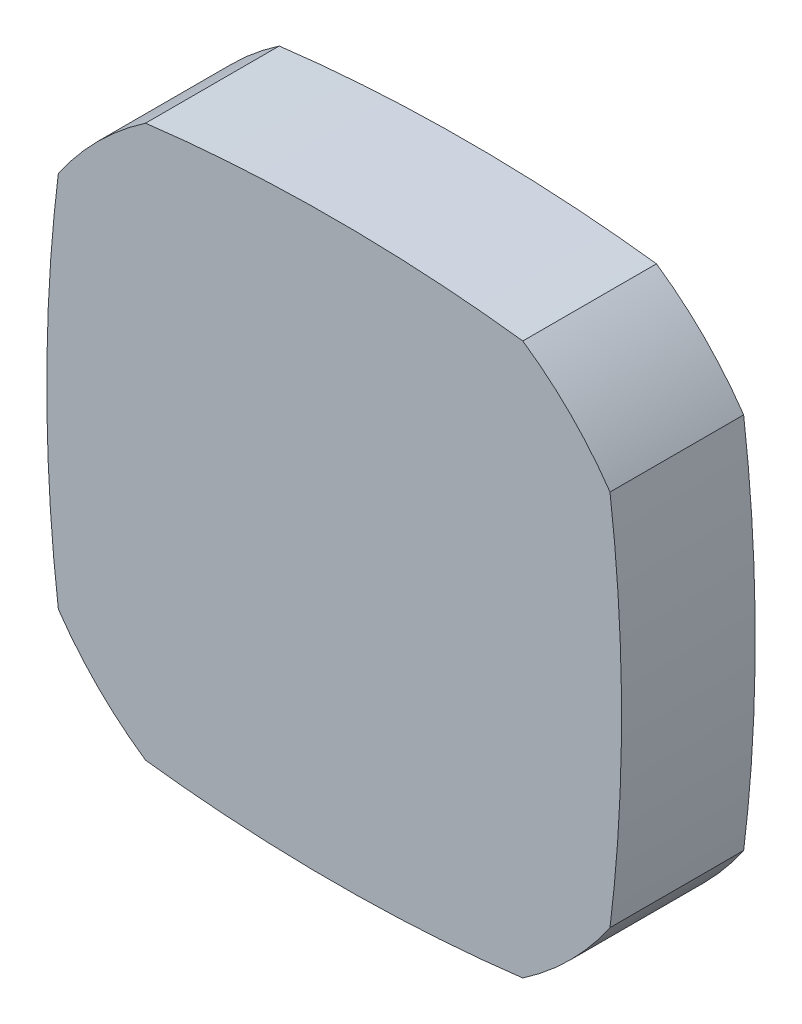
ISO-10303-21;
HEADER;
FILE_DESCRIPTION(('STEP AP214'),'2;1');
FILE_NAME('part.step','',(''),(''),'','','');
FILE_SCHEMA(('AUTOMOTIVE_DESIGN { 1 0 10303 214 1 1 1 1 }'));
ENDSEC;
DATA;
#1=APPLICATION_CONTEXT('core data for automotive mechanical design processes');
#2=APPLICATION_PROTOCOL_DEFINITION('international standard','automotive_design',2000,#1);
#3=PRODUCT_CONTEXT('',#1,'mechanical');
#4=PRODUCT('Part','Part','',(#3));
#5=PRODUCT_RELATED_PRODUCT_CATEGORY('part','',(#4));
#6=PRODUCT_DEFINITION_FORMATION('','',#4);
#7=PRODUCT_DEFINITION_CONTEXT('part definition',#1,'design');
#8=PRODUCT_DEFINITION('design','',#6,#7);
#9=PRODUCT_DEFINITION_SHAPE('','',#8);
#10=(LENGTH_UNIT() NAMED_UNIT(*) SI_UNIT(.MILLI.,.METRE.));
#11=(NAMED_UNIT(*) PLANE_ANGLE_UNIT() SI_UNIT($,.RADIAN.));
#12=(NAMED_UNIT(*) SI_UNIT($,.STERADIAN.) SOLID_ANGLE_UNIT());
#13=UNCERTAINTY_MEASURE_WITH_UNIT(LENGTH_MEASURE(1.E-05),#10,'distance_accuracy_value','');
#14=(GEOMETRIC_REPRESENTATION_CONTEXT(3) GLOBAL_UNCERTAINTY_ASSIGNED_CONTEXT((#13)) GLOBAL_UNIT_ASSIGNED_CONTEXT((#10,
#11,#12)) REPRESENTATION_CONTEXT('',''));
#15=CARTESIAN_POINT('',(0.,0.,0.));
#16=DIRECTION('',(0.,0.,1.));
#17=DIRECTION('',(1.,0.,0.));
#18=AXIS2_PLACEMENT_3D('',#15,#16,#17);
#19=CARTESIAN_POINT('',(14.1121650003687,20.6360558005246,10.));
#20=CARTESIAN_POINT('',(13.8078064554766,20.6733063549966,10.));
#21=CARTESIAN_POINT('',(13.1951830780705,20.7482855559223,10.));
#22=CARTESIAN_POINT('',(12.2694711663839,20.851373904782,10.));
#23=CARTESIAN_POINT('',(11.3320520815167,20.9482320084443,10.));
#24=CARTESIAN_POINT('',(10.3837103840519,21.0378521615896,10.));
#25=CARTESIAN_POINT('',(9.42536374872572,21.1201827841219,10.));
#26=CARTESIAN_POINT('',(8.45791296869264,21.1949385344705,10.));
#27=CARTESIAN_POINT('',(7.48228110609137,21.261925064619,10.));
#28=CARTESIAN_POINT('',(6.49940110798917,21.3209512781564,10.));
#29=CARTESIAN_POINT('',(5.51021740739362,21.3718536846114,10.));
#30=CARTESIAN_POINT('',(4.51568370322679,21.4144902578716,10.));
#31=CARTESIAN_POINT('',(3.5167617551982,21.4487424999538,10.));
#32=CARTESIAN_POINT('',(2.51441988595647,21.4745152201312,10.));
#33=CARTESIAN_POINT('',(1.50963154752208,21.4917368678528,10.));
#34=CARTESIAN_POINT('',(0.503373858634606,21.5003596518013,10.));
#35=CARTESIAN_POINT('',(-0.503373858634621,21.5003596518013,10.));
#36=CARTESIAN_POINT('',(-1.5096315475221,21.4917368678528,10.));
#37=CARTESIAN_POINT('',(-2.51441988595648,21.4745152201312,10.));
#38=CARTESIAN_POINT('',(-3.51676175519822,21.4487424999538,10.));
#39=CARTESIAN_POINT('',(-4.51568370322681,21.4144902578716,10.));
#40=CARTESIAN_POINT('',(-5.51021740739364,21.3718536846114,10.));
#41=CARTESIAN_POINT('',(-6.49940110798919,21.3209512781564,10.));
#42=CARTESIAN_POINT('',(-7.48228110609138,21.261925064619,10.));
#43=CARTESIAN_POINT('',(-8.45791296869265,21.1949385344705,10.));
#44=CARTESIAN_POINT('',(-9.42536374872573,21.1201827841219,10.));
#45=CARTESIAN_POINT('',(-10.3837103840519,21.0378521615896,10.));
#46=CARTESIAN_POINT('',(-11.3320520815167,20.9482320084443,10.));
#47=CARTESIAN_POINT('',(-12.2694711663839,20.851373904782,10.));
#48=CARTESIAN_POINT('',(-13.1951830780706,20.7482855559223,10.));
#49=CARTESIAN_POINT('',(-13.8078064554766,20.6733063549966,10.));
#50=CARTESIAN_POINT('',(-14.1121650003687,20.6360558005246,10.));
#51=B_SPLINE_CURVE_WITH_KNOTS('',3,(#19,#20,#21,#22,#23,#24,#25,#26,#27,#28,#29,#30,#31,#32,#33,
#34,#35,#36,#37,#38,#39,#40,#41,#42,#43,#44,#45,#46,#47,#48,#49,#50),.UNSPECIFIED.,.F.,.F.,(4,1,
1,1,1,1,1,1,1,1,1,1,1,1,1,1,1,1,1,1,1,1,1,1,1,1,1,1,1,4),(0.,0.032510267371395,
0.0654377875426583,0.0987536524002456,0.132428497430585,0.166432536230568,0.200735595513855,
0.235307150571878,0.270116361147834,0.305132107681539,0.340323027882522,0.375657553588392,
0.411103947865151,0.446630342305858,0.482204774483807,0.517795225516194,0.553369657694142,
0.588896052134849,0.624342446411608,0.659676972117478,0.694867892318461,0.729883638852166,
0.764692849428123,0.799264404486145,0.833567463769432,0.867571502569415,0.901246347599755,
0.934562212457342,0.967489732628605,1.),.UNSPECIFIED.);
#52=DIRECTION('',(0.,0.,-1.));
#53=VECTOR('',#52,1.);
#54=SURFACE_OF_LINEAR_EXTRUSION('',#51,#53);
#55=CARTESIAN_POINT('',(14.1121650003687,20.6360558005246,0.));
#56=CARTESIAN_POINT('',(13.8078064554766,20.6733063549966,0.));
#57=CARTESIAN_POINT('',(13.1951830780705,20.7482855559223,0.));
#58=CARTESIAN_POINT('',(12.2694711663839,20.851373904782,0.));
#59=CARTESIAN_POINT('',(11.3320520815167,20.9482320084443,0.));
#60=CARTESIAN_POINT('',(10.3837103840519,21.0378521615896,0.));
#61=CARTESIAN_POINT('',(9.42536374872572,21.1201827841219,0.));
#62=CARTESIAN_POINT('',(8.45791296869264,21.1949385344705,0.));
#63=CARTESIAN_POINT('',(7.48228110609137,21.261925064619,0.));
#64=CARTESIAN_POINT('',(6.49940110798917,21.3209512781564,0.));
#65=CARTESIAN_POINT('',(5.51021740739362,21.3718536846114,0.));
#66=CARTESIAN_POINT('',(4.51568370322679,21.4144902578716,0.));
#67=CARTESIAN_POINT('',(3.5167617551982,21.4487424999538,0.));
#68=CARTESIAN_POINT('',(2.51441988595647,21.4745152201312,0.));
#69=CARTESIAN_POINT('',(1.50963154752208,21.4917368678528,0.));
#70=CARTESIAN_POINT('',(0.503373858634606,21.5003596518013,0.));
#71=CARTESIAN_POINT('',(-0.503373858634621,21.5003596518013,0.));
#72=CARTESIAN_POINT('',(-1.5096315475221,21.4917368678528,0.));
#73=CARTESIAN_POINT('',(-2.51441988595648,21.4745152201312,0.));
#74=CARTESIAN_POINT('',(-3.51676175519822,21.4487424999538,0.));
#75=CARTESIAN_POINT('',(-4.51568370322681,21.4144902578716,0.));
#76=CARTESIAN_POINT('',(-5.51021740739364,21.3718536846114,0.));
#77=CARTESIAN_POINT('',(-6.49940110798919,21.3209512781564,0.));
#78=CARTESIAN_POINT('',(-7.48228110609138,21.261925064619,0.));
#79=CARTESIAN_POINT('',(-8.45791296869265,21.1949385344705,0.));
#80=CARTESIAN_POINT('',(-9.42536374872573,21.1201827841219,0.));
#81=CARTESIAN_POINT('',(-10.3837103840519,21.0378521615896,0.));
#82=CARTESIAN_POINT('',(-11.3320520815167,20.9482320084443,0.));
#83=CARTESIAN_POINT('',(-12.2694711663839,20.851373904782,0.));
#84=CARTESIAN_POINT('',(-13.1951830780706,20.7482855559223,0.));
#85=CARTESIAN_POINT('',(-13.8078064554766,20.6733063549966,0.));
#86=CARTESIAN_POINT('',(-14.1121650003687,20.6360558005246,0.));
#87=B_SPLINE_CURVE_WITH_KNOTS('',3,(#55,#56,#57,#58,#59,#60,#61,#62,#63,#64,#65,#66,#67,#68,#69,
#70,#71,#72,#73,#74,#75,#76,#77,#78,#79,#80,#81,#82,#83,#84,#85,#86),.UNSPECIFIED.,.F.,.F.,(4,1,
1,1,1,1,1,1,1,1,1,1,1,1,1,1,1,1,1,1,1,1,1,1,1,1,1,1,1,4),(0.,0.032510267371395,
0.0654377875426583,0.0987536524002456,0.132428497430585,0.166432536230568,0.200735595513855,
0.235307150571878,0.270116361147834,0.305132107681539,0.340323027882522,0.375657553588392,
0.411103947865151,0.446630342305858,0.482204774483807,0.517795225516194,0.553369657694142,
0.588896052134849,0.624342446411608,0.659676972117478,0.694867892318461,0.729883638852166,
0.764692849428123,0.799264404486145,0.833567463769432,0.867571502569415,0.901246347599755,
0.934562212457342,0.967489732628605,1.),.UNSPECIFIED.);
#88=CARTESIAN_POINT('',(14.1121650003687,20.6360558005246,0.));
#89=VERTEX_POINT('',#88);
#90=CARTESIAN_POINT('',(-14.1121650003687,20.6360558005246,0.));
#91=VERTEX_POINT('',#90);
#92=EDGE_CURVE('E104',#89,#91,#87,.T.);
#93=ORIENTED_EDGE('',*,*,#92,.T.);
#94=DIRECTION('',(0.,0.,-1.));
#95=VECTOR('',#94,1.);
#96=CARTESIAN_POINT('',(-14.1121650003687,20.6360558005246,10.));
#97=LINE('',#96,#95);
#98=CARTESIAN_POINT('',(-14.1121650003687,20.6360558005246,10.));
#99=VERTEX_POINT('',#98);
#100=EDGE_CURVE('E11',#99,#91,#97,.T.);
#101=ORIENTED_EDGE('',*,*,#100,.F.);
#102=CARTESIAN_POINT('',(14.1121650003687,20.6360558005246,10.));
#103=VERTEX_POINT('',#102);
#104=EDGE_CURVE('E150',#103,#99,#51,.T.);
#105=ORIENTED_EDGE('',*,*,#104,.F.);
#106=DIRECTION('',(0.,0.,-1.));
#107=VECTOR('',#106,1.);
#108=CARTESIAN_POINT('',(14.1121650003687,20.6360558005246,10.));
#109=LINE('',#108,#107);
#110=EDGE_CURVE('E117',#103,#89,#109,.T.);
#111=ORIENTED_EDGE('',*,*,#110,.T.);
#112=EDGE_LOOP('',(#93,#101,#105,#111));
#113=FACE_BOUND('',#112,.T.);
#114=ADVANCED_FACE('F35',(#113),#54,.F.);
#115=CARTESIAN_POINT('',(0.,0.,10.));
#116=DIRECTION('',(0.,0.,-1.));
#117=DIRECTION('',(-1.,0.,0.));
#118=AXIS2_PLACEMENT_3D('',#115,#116,#117);
#119=CYLINDRICAL_SURFACE('',#118,24.9999999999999);
#120=CARTESIAN_POINT('',(0.,0.,0.));
#121=DIRECTION('',(0.,0.,1.));
#122=DIRECTION('',(-1.,0.,0.));
#123=AXIS2_PLACEMENT_3D('',#120,#121,#122);
#124=CIRCLE('',#123,24.9999999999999);
#125=CARTESIAN_POINT('',(-20.6360558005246,14.1121650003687,0.));
#126=VERTEX_POINT('',#125);
#127=EDGE_CURVE('E100',#91,#126,#124,.T.);
#128=ORIENTED_EDGE('',*,*,#127,.T.);
#129=DIRECTION('',(0.,0.,-1.));
#130=VECTOR('',#129,1.);
#131=CARTESIAN_POINT('',(-20.6360558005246,14.1121650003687,10.));
#132=LINE('',#131,#130);
#133=CARTESIAN_POINT('',(-20.6360558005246,14.1121650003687,10.));
#134=VERTEX_POINT('',#133);
#135=EDGE_CURVE('E43',#134,#126,#132,.T.);
#136=ORIENTED_EDGE('',*,*,#135,.F.);
#137=CARTESIAN_POINT('',(0.,0.,10.));
#138=DIRECTION('',(0.,0.,1.));
#139=DIRECTION('',(-1.,0.,0.));
#140=AXIS2_PLACEMENT_3D('',#137,#138,#139);
#141=CIRCLE('',#140,24.9999999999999);
#142=EDGE_CURVE('E113',#99,#134,#141,.T.);
#143=ORIENTED_EDGE('',*,*,#142,.F.);
#144=ORIENTED_EDGE('',*,*,#100,.T.);
#145=EDGE_LOOP('',(#128,#136,#143,#144));
#146=FACE_BOUND('',#145,.T.);
#147=ADVANCED_FACE('F112',(#146),#119,.T.);
#148=CARTESIAN_POINT('',(-20.6360558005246,14.1121650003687,10.));
#149=CARTESIAN_POINT('',(-20.6733063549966,13.8078064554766,10.));
#150=CARTESIAN_POINT('',(-20.7482855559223,13.1951830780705,10.));
#151=CARTESIAN_POINT('',(-20.851373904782,12.2694711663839,10.));
#152=CARTESIAN_POINT('',(-20.9482320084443,11.3320520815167,10.));
#153=CARTESIAN_POINT('',(-21.0378521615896,10.3837103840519,10.));
#154=CARTESIAN_POINT('',(-21.1201827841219,9.42536374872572,10.));
#155=CARTESIAN_POINT('',(-21.1949385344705,8.45791296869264,10.));
#156=CARTESIAN_POINT('',(-21.261925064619,7.48228110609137,10.));
#157=CARTESIAN_POINT('',(-21.3209512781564,6.49940110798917,10.));
#158=CARTESIAN_POINT('',(-21.3718536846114,5.51021740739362,10.));
#159=CARTESIAN_POINT('',(-21.4144902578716,4.51568370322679,10.));
#160=CARTESIAN_POINT('',(-21.4487424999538,3.5167617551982,10.));
#161=CARTESIAN_POINT('',(-21.4745152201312,2.51441988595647,10.));
#162=CARTESIAN_POINT('',(-21.4917368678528,1.50963154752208,10.));
#163=CARTESIAN_POINT('',(-21.5003596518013,0.503373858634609,10.));
#164=CARTESIAN_POINT('',(-21.5003596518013,-0.503373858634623,10.));
#165=CARTESIAN_POINT('',(-21.4917368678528,-1.5096315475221,10.));
#166=CARTESIAN_POINT('',(-21.4745152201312,-2.51441988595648,10.));
#167=CARTESIAN_POINT('',(-21.4487424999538,-3.51676175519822,10.));
#168=CARTESIAN_POINT('',(-21.4144902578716,-4.51568370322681,10.));
#169=CARTESIAN_POINT('',(-21.3718536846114,-5.51021740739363,10.));
#170=CARTESIAN_POINT('',(-21.3209512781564,-6.49940110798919,10.));
#171=CARTESIAN_POINT('',(-21.261925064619,-7.48228110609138,10.));
#172=CARTESIAN_POINT('',(-21.1949385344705,-8.45791296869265,10.));
#173=CARTESIAN_POINT('',(-21.1201827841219,-9.42536374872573,10.));
#174=CARTESIAN_POINT('',(-21.0378521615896,-10.3837103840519,10.));
#175=CARTESIAN_POINT('',(-20.9482320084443,-11.3320520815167,10.));
#176=CARTESIAN_POINT('',(-20.851373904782,-12.2694711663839,10.));
#177=CARTESIAN_POINT('',(-20.7482855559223,-13.1951830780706,10.));
#178=CARTESIAN_POINT('',(-20.6733063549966,-13.8078064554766,10.));
#179=CARTESIAN_POINT('',(-20.6360558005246,-14.1121650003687,10.));
#180=B_SPLINE_CURVE_WITH_KNOTS('',3,(#148,#149,#150,#151,#152,#153,#154,#155,#156,#157,#158,
#159,#160,#161,#162,#163,#164,#165,#166,#167,#168,#169,#170,#171,#172,#173,#174,#175,#176,#177,
#178,#179),.UNSPECIFIED.,.F.,.F.,(4,1,1,1,1,1,1,1,1,1,1,1,1,1,1,1,1,1,1,1,1,1,1,1,1,1,1,1,1,4),
(0.,0.0325102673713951,0.0654377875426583,0.0987536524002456,0.132428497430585,
0.166432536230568,0.200735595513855,0.235307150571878,0.270116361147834,0.305132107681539,
0.340323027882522,0.375657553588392,0.411103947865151,0.446630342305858,0.482204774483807,
0.517795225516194,0.553369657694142,0.58889605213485,0.624342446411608,0.659676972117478,
0.694867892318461,0.729883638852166,0.764692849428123,0.799264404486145,0.833567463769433,
0.867571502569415,0.901246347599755,0.934562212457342,0.967489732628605,1.),.UNSPECIFIED.);
#181=DIRECTION('',(0.,0.,-1.));
#182=VECTOR('',#181,1.);
#183=SURFACE_OF_LINEAR_EXTRUSION('',#180,#182);
#184=CARTESIAN_POINT('',(-20.6360558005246,14.1121650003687,0.));
#185=CARTESIAN_POINT('',(-20.6733063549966,13.8078064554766,0.));
#186=CARTESIAN_POINT('',(-20.7482855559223,13.1951830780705,0.));
#187=CARTESIAN_POINT('',(-20.851373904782,12.2694711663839,0.));
#188=CARTESIAN_POINT('',(-20.9482320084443,11.3320520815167,0.));
#189=CARTESIAN_POINT('',(-21.0378521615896,10.3837103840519,0.));
#190=CARTESIAN_POINT('',(-21.1201827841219,9.42536374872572,0.));
#191=CARTESIAN_POINT('',(-21.1949385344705,8.45791296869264,0.));
#192=CARTESIAN_POINT('',(-21.261925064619,7.48228110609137,0.));
#193=CARTESIAN_POINT('',(-21.3209512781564,6.49940110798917,0.));
#194=CARTESIAN_POINT('',(-21.3718536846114,5.51021740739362,0.));
#195=CARTESIAN_POINT('',(-21.4144902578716,4.51568370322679,0.));
#196=CARTESIAN_POINT('',(-21.4487424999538,3.5167617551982,0.));
#197=CARTESIAN_POINT('',(-21.4745152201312,2.51441988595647,0.));
#198=CARTESIAN_POINT('',(-21.4917368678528,1.50963154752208,0.));
#199=CARTESIAN_POINT('',(-21.5003596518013,0.503373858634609,0.));
#200=CARTESIAN_POINT('',(-21.5003596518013,-0.503373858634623,0.));
#201=CARTESIAN_POINT('',(-21.4917368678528,-1.5096315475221,0.));
#202=CARTESIAN_POINT('',(-21.4745152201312,-2.51441988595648,0.));
#203=CARTESIAN_POINT('',(-21.4487424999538,-3.51676175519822,0.));
#204=CARTESIAN_POINT('',(-21.4144902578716,-4.51568370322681,0.));
#205=CARTESIAN_POINT('',(-21.3718536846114,-5.51021740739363,0.));
#206=CARTESIAN_POINT('',(-21.3209512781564,-6.49940110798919,0.));
#207=CARTESIAN_POINT('',(-21.261925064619,-7.48228110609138,0.));
#208=CARTESIAN_POINT('',(-21.1949385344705,-8.45791296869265,0.));
#209=CARTESIAN_POINT('',(-21.1201827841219,-9.42536374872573,0.));
#210=CARTESIAN_POINT('',(-21.0378521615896,-10.3837103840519,0.));
#211=CARTESIAN_POINT('',(-20.9482320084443,-11.3320520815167,0.));
#212=CARTESIAN_POINT('',(-20.851373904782,-12.2694711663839,0.));
#213=CARTESIAN_POINT('',(-20.7482855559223,-13.1951830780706,0.));
#214=CARTESIAN_POINT('',(-20.6733063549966,-13.8078064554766,0.));
#215=CARTESIAN_POINT('',(-20.6360558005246,-14.1121650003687,0.));
#216=B_SPLINE_CURVE_WITH_KNOTS('',3,(#184,#185,#186,#187,#188,#189,#190,#191,#192,#193,#194,
#195,#196,#197,#198,#199,#200,#201,#202,#203,#204,#205,#206,#207,#208,#209,#210,#211,#212,#213,
#214,#215),.UNSPECIFIED.,.F.,.F.,(4,1,1,1,1,1,1,1,1,1,1,1,1,1,1,1,1,1,1,1,1,1,1,1,1,1,1,1,1,4),
(0.,0.0325102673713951,0.0654377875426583,0.0987536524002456,0.132428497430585,
0.166432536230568,0.200735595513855,0.235307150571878,0.270116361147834,0.305132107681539,
0.340323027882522,0.375657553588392,0.411103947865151,0.446630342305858,0.482204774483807,
0.517795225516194,0.553369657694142,0.58889605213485,0.624342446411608,0.659676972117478,
0.694867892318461,0.729883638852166,0.764692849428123,0.799264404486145,0.833567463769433,
0.867571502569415,0.901246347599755,0.934562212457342,0.967489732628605,1.),.UNSPECIFIED.);
#217=CARTESIAN_POINT('',(-20.6360558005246,-14.1121650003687,0.));
#218=VERTEX_POINT('',#217);
#219=EDGE_CURVE('E106',#126,#218,#216,.T.);
#220=ORIENTED_EDGE('',*,*,#219,.T.);
#221=DIRECTION('',(0.,0.,-1.));
#222=VECTOR('',#221,1.);
#223=CARTESIAN_POINT('',(-20.6360558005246,-14.1121650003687,10.));
#224=LINE('',#223,#222);
#225=CARTESIAN_POINT('',(-20.6360558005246,-14.1121650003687,10.));
#226=VERTEX_POINT('',#225);
#227=EDGE_CURVE('E284',#226,#218,#224,.T.);
#228=ORIENTED_EDGE('',*,*,#227,.F.);
#229=EDGE_CURVE('E159',#134,#226,#180,.T.);
#230=ORIENTED_EDGE('',*,*,#229,.F.);
#231=ORIENTED_EDGE('',*,*,#135,.T.);
#232=EDGE_LOOP('',(#220,#228,#230,#231));
#233=FACE_BOUND('',#232,.T.);
#234=ADVANCED_FACE('F170',(#233),#183,.F.);
#235=CARTESIAN_POINT('',(0.,0.,10.));
#236=DIRECTION('',(0.,0.,-1.));
#237=DIRECTION('',(-1.,0.,0.));
#238=AXIS2_PLACEMENT_3D('',#235,#236,#237);
#239=CYLINDRICAL_SURFACE('',#238,24.9999999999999);
#240=CARTESIAN_POINT('',(0.,0.,0.));
#241=DIRECTION('',(0.,0.,1.));
#242=DIRECTION('',(-1.,0.,0.));
#243=AXIS2_PLACEMENT_3D('',#240,#241,#242);
#244=CIRCLE('',#243,24.9999999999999);
#245=CARTESIAN_POINT('',(-14.1121650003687,-20.6360558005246,0.));
#246=VERTEX_POINT('',#245);
#247=EDGE_CURVE('E128',#218,#246,#244,.T.);
#248=ORIENTED_EDGE('',*,*,#247,.T.);
#249=DIRECTION('',(0.,0.,-1.));
#250=VECTOR('',#249,1.);
#251=CARTESIAN_POINT('',(-14.1121650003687,-20.6360558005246,10.));
#252=LINE('',#251,#250);
#253=CARTESIAN_POINT('',(-14.1121650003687,-20.6360558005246,10.));
#254=VERTEX_POINT('',#253);
#255=EDGE_CURVE('E281',#254,#246,#252,.T.);
#256=ORIENTED_EDGE('',*,*,#255,.F.);
#257=CARTESIAN_POINT('',(0.,0.,10.));
#258=DIRECTION('',(0.,0.,1.));
#259=DIRECTION('',(-1.,0.,0.));
#260=AXIS2_PLACEMENT_3D('',#257,#258,#259);
#261=CIRCLE('',#260,24.9999999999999);
#262=EDGE_CURVE('E164',#226,#254,#261,.T.);
#263=ORIENTED_EDGE('',*,*,#262,.F.);
#264=ORIENTED_EDGE('',*,*,#227,.T.);
#265=EDGE_LOOP('',(#248,#256,#263,#264));
#266=FACE_BOUND('',#265,.T.);
#267=ADVANCED_FACE('F173',(#266),#239,.T.);
#268=CARTESIAN_POINT('',(-14.1121650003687,-20.6360558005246,10.));
#269=CARTESIAN_POINT('',(-13.8078064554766,-20.6733063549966,10.));
#270=CARTESIAN_POINT('',(-13.1951830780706,-20.7482855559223,10.));
#271=CARTESIAN_POINT('',(-12.2694711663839,-20.851373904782,10.));
#272=CARTESIAN_POINT('',(-11.3320520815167,-20.9482320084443,10.));
#273=CARTESIAN_POINT('',(-10.3837103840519,-21.0378521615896,10.));
#274=CARTESIAN_POINT('',(-9.42536374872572,-21.1201827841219,10.));
#275=CARTESIAN_POINT('',(-8.45791296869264,-21.1949385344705,10.));
#276=CARTESIAN_POINT('',(-7.48228110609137,-21.261925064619,10.));
#277=CARTESIAN_POINT('',(-6.49940110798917,-21.3209512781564,10.));
#278=CARTESIAN_POINT('',(-5.51021740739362,-21.3718536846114,10.));
#279=CARTESIAN_POINT('',(-4.5156837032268,-21.4144902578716,10.));
#280=CARTESIAN_POINT('',(-3.5167617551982,-21.4487424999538,10.));
#281=CARTESIAN_POINT('',(-2.51441988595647,-21.4745152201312,10.));
#282=CARTESIAN_POINT('',(-1.50963154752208,-21.4917368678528,10.));
#283=CARTESIAN_POINT('',(-0.503373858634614,-21.5003596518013,10.));
#284=CARTESIAN_POINT('',(0.503373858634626,-21.5003596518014,10.));
#285=CARTESIAN_POINT('',(1.50963154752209,-21.4917368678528,10.));
#286=CARTESIAN_POINT('',(2.51441988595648,-21.4745152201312,10.));
#287=CARTESIAN_POINT('',(3.51676175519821,-21.4487424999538,10.));
#288=CARTESIAN_POINT('',(4.5156837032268,-21.4144902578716,10.));
#289=CARTESIAN_POINT('',(5.51021740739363,-21.3718536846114,10.));
#290=CARTESIAN_POINT('',(6.49940110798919,-21.3209512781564,10.));
#291=CARTESIAN_POINT('',(7.48228110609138,-21.261925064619,10.));
#292=CARTESIAN_POINT('',(8.45791296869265,-21.1949385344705,10.));
#293=CARTESIAN_POINT('',(9.42536374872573,-21.1201827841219,10.));
#294=CARTESIAN_POINT('',(10.3837103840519,-21.0378521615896,10.));
#295=CARTESIAN_POINT('',(11.3320520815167,-20.9482320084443,10.));
#296=CARTESIAN_POINT('',(12.2694711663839,-20.851373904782,10.));
#297=CARTESIAN_POINT('',(13.1951830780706,-20.7482855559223,10.));
#298=CARTESIAN_POINT('',(13.8078064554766,-20.6733063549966,10.));
#299=CARTESIAN_POINT('',(14.1121650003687,-20.6360558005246,10.));
#300=B_SPLINE_CURVE_WITH_KNOTS('',3,(#268,#269,#270,#271,#272,#273,#274,#275,#276,#277,#278,
#279,#280,#281,#282,#283,#284,#285,#286,#287,#288,#289,#290,#291,#292,#293,#294,#295,#296,#297,
#298,#299),.UNSPECIFIED.,.F.,.F.,(4,1,1,1,1,1,1,1,1,1,1,1,1,1,1,1,1,1,1,1,1,1,1,1,1,1,1,1,1,4),
(0.,0.0325102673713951,0.0654377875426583,0.0987536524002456,0.132428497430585,
0.166432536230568,0.200735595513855,0.235307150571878,0.270116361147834,0.305132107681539,
0.340323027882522,0.375657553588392,0.411103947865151,0.446630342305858,0.482204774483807,
0.517795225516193,0.553369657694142,0.58889605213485,0.624342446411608,0.659676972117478,
0.694867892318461,0.729883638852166,0.764692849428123,0.799264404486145,0.833567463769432,
0.867571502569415,0.901246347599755,0.934562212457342,0.967489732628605,1.),.UNSPECIFIED.);
#301=DIRECTION('',(0.,0.,-1.));
#302=VECTOR('',#301,1.);
#303=SURFACE_OF_LINEAR_EXTRUSION('',#300,#302);
#304=CARTESIAN_POINT('',(-14.1121650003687,-20.6360558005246,0.));
#305=CARTESIAN_POINT('',(-13.8078064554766,-20.6733063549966,0.));
#306=CARTESIAN_POINT('',(-13.1951830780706,-20.7482855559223,0.));
#307=CARTESIAN_POINT('',(-12.2694711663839,-20.851373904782,0.));
#308=CARTESIAN_POINT('',(-11.3320520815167,-20.9482320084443,0.));
#309=CARTESIAN_POINT('',(-10.3837103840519,-21.0378521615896,0.));
#310=CARTESIAN_POINT('',(-9.42536374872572,-21.1201827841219,0.));
#311=CARTESIAN_POINT('',(-8.45791296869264,-21.1949385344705,0.));
#312=CARTESIAN_POINT('',(-7.48228110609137,-21.261925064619,0.));
#313=CARTESIAN_POINT('',(-6.49940110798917,-21.3209512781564,0.));
#314=CARTESIAN_POINT('',(-5.51021740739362,-21.3718536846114,0.));
#315=CARTESIAN_POINT('',(-4.5156837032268,-21.4144902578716,0.));
#316=CARTESIAN_POINT('',(-3.5167617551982,-21.4487424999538,0.));
#317=CARTESIAN_POINT('',(-2.51441988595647,-21.4745152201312,0.));
#318=CARTESIAN_POINT('',(-1.50963154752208,-21.4917368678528,0.));
#319=CARTESIAN_POINT('',(-0.503373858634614,-21.5003596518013,0.));
#320=CARTESIAN_POINT('',(0.503373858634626,-21.5003596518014,0.));
#321=CARTESIAN_POINT('',(1.50963154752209,-21.4917368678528,0.));
#322=CARTESIAN_POINT('',(2.51441988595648,-21.4745152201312,0.));
#323=CARTESIAN_POINT('',(3.51676175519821,-21.4487424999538,0.));
#324=CARTESIAN_POINT('',(4.5156837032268,-21.4144902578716,0.));
#325=CARTESIAN_POINT('',(5.51021740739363,-21.3718536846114,0.));
#326=CARTESIAN_POINT('',(6.49940110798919,-21.3209512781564,0.));
#327=CARTESIAN_POINT('',(7.48228110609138,-21.261925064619,0.));
#328=CARTESIAN_POINT('',(8.45791296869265,-21.1949385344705,0.));
#329=CARTESIAN_POINT('',(9.42536374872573,-21.1201827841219,0.));
#330=CARTESIAN_POINT('',(10.3837103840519,-21.0378521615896,0.));
#331=CARTESIAN_POINT('',(11.3320520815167,-20.9482320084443,0.));
#332=CARTESIAN_POINT('',(12.2694711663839,-20.851373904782,0.));
#333=CARTESIAN_POINT('',(13.1951830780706,-20.7482855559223,0.));
#334=CARTESIAN_POINT('',(13.8078064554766,-20.6733063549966,0.));
#335=CARTESIAN_POINT('',(14.1121650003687,-20.6360558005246,0.));
#336=B_SPLINE_CURVE_WITH_KNOTS('',3,(#304,#305,#306,#307,#308,#309,#310,#311,#312,#313,#314,
#315,#316,#317,#318,#319,#320,#321,#322,#323,#324,#325,#326,#327,#328,#329,#330,#331,#332,#333,
#334,#335),.UNSPECIFIED.,.F.,.F.,(4,1,1,1,1,1,1,1,1,1,1,1,1,1,1,1,1,1,1,1,1,1,1,1,1,1,1,1,1,4),
(0.,0.0325102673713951,0.0654377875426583,0.0987536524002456,0.132428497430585,
0.166432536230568,0.200735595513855,0.235307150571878,0.270116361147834,0.305132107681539,
0.340323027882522,0.375657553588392,0.411103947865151,0.446630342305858,0.482204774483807,
0.517795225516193,0.553369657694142,0.58889605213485,0.624342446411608,0.659676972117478,
0.694867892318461,0.729883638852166,0.764692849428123,0.799264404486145,0.833567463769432,
0.867571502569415,0.901246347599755,0.934562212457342,0.967489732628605,1.),.UNSPECIFIED.);
#337=CARTESIAN_POINT('',(14.1121650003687,-20.6360558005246,0.));
#338=VERTEX_POINT('',#337);
#339=EDGE_CURVE('E133',#246,#338,#336,.T.);
#340=ORIENTED_EDGE('',*,*,#339,.T.);
#341=DIRECTION('',(0.,0.,-1.));
#342=VECTOR('',#341,1.);
#343=CARTESIAN_POINT('',(14.1121650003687,-20.6360558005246,10.));
#344=LINE('',#343,#342);
#345=CARTESIAN_POINT('',(14.1121650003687,-20.6360558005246,10.));
#346=VERTEX_POINT('',#345);
#347=EDGE_CURVE('E278',#346,#338,#344,.T.);
#348=ORIENTED_EDGE('',*,*,#347,.F.);
#349=EDGE_CURVE('E291',#254,#346,#300,.T.);
#350=ORIENTED_EDGE('',*,*,#349,.F.);
#351=ORIENTED_EDGE('',*,*,#255,.T.);
#352=EDGE_LOOP('',(#340,#348,#350,#351));
#353=FACE_BOUND('',#352,.T.);
#354=ADVANCED_FACE('F201',(#353),#303,.F.);
#355=CARTESIAN_POINT('',(0.,0.,10.));
#356=DIRECTION('',(0.,0.,-1.));
#357=DIRECTION('',(-1.,0.,0.));
#358=AXIS2_PLACEMENT_3D('',#355,#356,#357);
#359=CYLINDRICAL_SURFACE('',#358,24.9999999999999);
#360=CARTESIAN_POINT('',(0.,0.,0.));
#361=DIRECTION('',(0.,0.,1.));
#362=DIRECTION('',(-1.,0.,0.));
#363=AXIS2_PLACEMENT_3D('',#360,#361,#362);
#364=CIRCLE('',#363,24.9999999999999);
#365=CARTESIAN_POINT('',(20.6360558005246,-14.1121650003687,0.));
#366=VERTEX_POINT('',#365);
#367=EDGE_CURVE('E137',#338,#366,#364,.T.);
#368=ORIENTED_EDGE('',*,*,#367,.T.);
#369=DIRECTION('',(0.,0.,-1.));
#370=VECTOR('',#369,1.);
#371=CARTESIAN_POINT('',(20.6360558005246,-14.1121650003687,10.));
#372=LINE('',#371,#370);
#373=CARTESIAN_POINT('',(20.6360558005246,-14.1121650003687,10.));
#374=VERTEX_POINT('',#373);
#375=EDGE_CURVE('E275',#374,#366,#372,.T.);
#376=ORIENTED_EDGE('',*,*,#375,.F.);
#377=CARTESIAN_POINT('',(0.,0.,10.));
#378=DIRECTION('',(0.,0.,1.));
#379=DIRECTION('',(-1.,0.,0.));
#380=AXIS2_PLACEMENT_3D('',#377,#378,#379);
#381=CIRCLE('',#380,24.9999999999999);
#382=EDGE_CURVE('E266',#346,#374,#381,.T.);
#383=ORIENTED_EDGE('',*,*,#382,.F.);
#384=ORIENTED_EDGE('',*,*,#347,.T.);
#385=EDGE_LOOP('',(#368,#376,#383,#384));
#386=FACE_BOUND('',#385,.T.);
#387=ADVANCED_FACE('F210',(#386),#359,.T.);
#388=CARTESIAN_POINT('',(20.6360558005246,-14.1121650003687,10.));
#389=CARTESIAN_POINT('',(20.6733063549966,-13.8078064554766,10.));
#390=CARTESIAN_POINT('',(20.7482855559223,-13.1951830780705,10.));
#391=CARTESIAN_POINT('',(20.851373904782,-12.2694711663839,10.));
#392=CARTESIAN_POINT('',(20.9482320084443,-11.3320520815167,10.));
#393=CARTESIAN_POINT('',(21.0378521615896,-10.3837103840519,10.));
#394=CARTESIAN_POINT('',(21.1201827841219,-9.42536374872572,10.));
#395=CARTESIAN_POINT('',(21.1949385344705,-8.45791296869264,10.));
#396=CARTESIAN_POINT('',(21.261925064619,-7.48228110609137,10.));
#397=CARTESIAN_POINT('',(21.3209512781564,-6.49940110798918,10.));
#398=CARTESIAN_POINT('',(21.3718536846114,-5.51021740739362,10.));
#399=CARTESIAN_POINT('',(21.4144902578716,-4.5156837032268,10.));
#400=CARTESIAN_POINT('',(21.4487424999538,-3.5167617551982,10.));
#401=CARTESIAN_POINT('',(21.4745152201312,-2.51441988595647,10.));
#402=CARTESIAN_POINT('',(21.4917368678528,-1.50963154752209,10.));
#403=CARTESIAN_POINT('',(21.5003596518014,-0.503373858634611,10.));
#404=CARTESIAN_POINT('',(21.5003596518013,0.503373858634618,10.));
#405=CARTESIAN_POINT('',(21.4917368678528,1.5096315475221,10.));
#406=CARTESIAN_POINT('',(21.4745152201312,2.51441988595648,10.));
#407=CARTESIAN_POINT('',(21.4487424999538,3.51676175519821,10.));
#408=CARTESIAN_POINT('',(21.4144902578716,4.5156837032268,10.));
#409=CARTESIAN_POINT('',(21.3718536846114,5.51021740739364,10.));
#410=CARTESIAN_POINT('',(21.3209512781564,6.49940110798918,10.));
#411=CARTESIAN_POINT('',(21.261925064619,7.48228110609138,10.));
#412=CARTESIAN_POINT('',(21.1949385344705,8.45791296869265,10.));
#413=CARTESIAN_POINT('',(21.1201827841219,9.42536374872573,10.));
#414=CARTESIAN_POINT('',(21.0378521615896,10.3837103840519,10.));
#415=CARTESIAN_POINT('',(20.9482320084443,11.3320520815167,10.));
#416=CARTESIAN_POINT('',(20.851373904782,12.2694711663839,10.));
#417=CARTESIAN_POINT('',(20.7482855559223,13.1951830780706,10.));
#418=CARTESIAN_POINT('',(20.6733063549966,13.8078064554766,10.));
#419=CARTESIAN_POINT('',(20.6360558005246,14.1121650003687,10.));
#420=B_SPLINE_CURVE_WITH_KNOTS('',3,(#388,#389,#390,#391,#392,#393,#394,#395,#396,#397,#398,
#399,#400,#401,#402,#403,#404,#405,#406,#407,#408,#409,#410,#411,#412,#413,#414,#415,#416,#417,
#418,#419),.UNSPECIFIED.,.F.,.F.,(4,1,1,1,1,1,1,1,1,1,1,1,1,1,1,1,1,1,1,1,1,1,1,1,1,1,1,1,1,4),
(0.,0.0325102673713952,0.0654377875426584,0.0987536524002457,0.132428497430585,
0.166432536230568,0.200735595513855,0.235307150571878,0.270116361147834,0.305132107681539,
0.340323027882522,0.375657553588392,0.411103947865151,0.446630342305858,0.482204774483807,
0.517795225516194,0.553369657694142,0.588896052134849,0.624342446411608,0.659676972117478,
0.694867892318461,0.729883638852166,0.764692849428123,0.799264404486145,0.833567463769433,
0.867571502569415,0.901246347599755,0.934562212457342,0.967489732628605,1.),.UNSPECIFIED.);
#421=DIRECTION('',(0.,0.,-1.));
#422=VECTOR('',#421,1.);
#423=SURFACE_OF_LINEAR_EXTRUSION('',#420,#422);
#424=CARTESIAN_POINT('',(20.6360558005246,-14.1121650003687,0.));
#425=CARTESIAN_POINT('',(20.6733063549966,-13.8078064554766,0.));
#426=CARTESIAN_POINT('',(20.7482855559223,-13.1951830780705,0.));
#427=CARTESIAN_POINT('',(20.851373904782,-12.2694711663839,0.));
#428=CARTESIAN_POINT('',(20.9482320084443,-11.3320520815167,0.));
#429=CARTESIAN_POINT('',(21.0378521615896,-10.3837103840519,0.));
#430=CARTESIAN_POINT('',(21.1201827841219,-9.42536374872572,0.));
#431=CARTESIAN_POINT('',(21.1949385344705,-8.45791296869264,0.));
#432=CARTESIAN_POINT('',(21.261925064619,-7.48228110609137,0.));
#433=CARTESIAN_POINT('',(21.3209512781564,-6.49940110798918,0.));
#434=CARTESIAN_POINT('',(21.3718536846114,-5.51021740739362,0.));
#435=CARTESIAN_POINT('',(21.4144902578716,-4.5156837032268,0.));
#436=CARTESIAN_POINT('',(21.4487424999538,-3.5167617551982,0.));
#437=CARTESIAN_POINT('',(21.4745152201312,-2.51441988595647,0.));
#438=CARTESIAN_POINT('',(21.4917368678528,-1.50963154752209,0.));
#439=CARTESIAN_POINT('',(21.5003596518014,-0.503373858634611,0.));
#440=CARTESIAN_POINT('',(21.5003596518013,0.503373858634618,0.));
#441=CARTESIAN_POINT('',(21.4917368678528,1.5096315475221,0.));
#442=CARTESIAN_POINT('',(21.4745152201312,2.51441988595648,0.));
#443=CARTESIAN_POINT('',(21.4487424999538,3.51676175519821,0.));
#444=CARTESIAN_POINT('',(21.4144902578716,4.5156837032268,0.));
#445=CARTESIAN_POINT('',(21.3718536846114,5.51021740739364,0.));
#446=CARTESIAN_POINT('',(21.3209512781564,6.49940110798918,0.));
#447=CARTESIAN_POINT('',(21.261925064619,7.48228110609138,0.));
#448=CARTESIAN_POINT('',(21.1949385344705,8.45791296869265,0.));
#449=CARTESIAN_POINT('',(21.1201827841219,9.42536374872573,0.));
#450=CARTESIAN_POINT('',(21.0378521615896,10.3837103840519,0.));
#451=CARTESIAN_POINT('',(20.9482320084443,11.3320520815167,0.));
#452=CARTESIAN_POINT('',(20.851373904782,12.2694711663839,0.));
#453=CARTESIAN_POINT('',(20.7482855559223,13.1951830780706,0.));
#454=CARTESIAN_POINT('',(20.6733063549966,13.8078064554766,0.));
#455=CARTESIAN_POINT('',(20.6360558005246,14.1121650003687,0.));
#456=B_SPLINE_CURVE_WITH_KNOTS('',3,(#424,#425,#426,#427,#428,#429,#430,#431,#432,#433,#434,
#435,#436,#437,#438,#439,#440,#441,#442,#443,#444,#445,#446,#447,#448,#449,#450,#451,#452,#453,
#454,#455),.UNSPECIFIED.,.F.,.F.,(4,1,1,1,1,1,1,1,1,1,1,1,1,1,1,1,1,1,1,1,1,1,1,1,1,1,1,1,1,4),
(0.,0.0325102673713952,0.0654377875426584,0.0987536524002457,0.132428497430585,
0.166432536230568,0.200735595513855,0.235307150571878,0.270116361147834,0.305132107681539,
0.340323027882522,0.375657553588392,0.411103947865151,0.446630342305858,0.482204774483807,
0.517795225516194,0.553369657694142,0.588896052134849,0.624342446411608,0.659676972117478,
0.694867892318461,0.729883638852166,0.764692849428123,0.799264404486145,0.833567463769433,
0.867571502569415,0.901246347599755,0.934562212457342,0.967489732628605,1.),.UNSPECIFIED.);
#457=CARTESIAN_POINT('',(20.6360558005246,14.1121650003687,0.));
#458=VERTEX_POINT('',#457);
#459=EDGE_CURVE('E142',#366,#458,#456,.T.);
#460=ORIENTED_EDGE('',*,*,#459,.T.);
#461=DIRECTION('',(0.,0.,-1.));
#462=VECTOR('',#461,1.);
#463=CARTESIAN_POINT('',(20.6360558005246,14.1121650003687,10.));
#464=LINE('',#463,#462);
#465=CARTESIAN_POINT('',(20.6360558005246,14.1121650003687,10.));
#466=VERTEX_POINT('',#465);
#467=EDGE_CURVE('E272',#466,#458,#464,.T.);
#468=ORIENTED_EDGE('',*,*,#467,.F.);
#469=EDGE_CURVE('E55',#374,#466,#420,.T.);
#470=ORIENTED_EDGE('',*,*,#469,.F.);
#471=ORIENTED_EDGE('',*,*,#375,.T.);
#472=EDGE_LOOP('',(#460,#468,#470,#471));
#473=FACE_BOUND('',#472,.T.);
#474=ADVANCED_FACE('F219',(#473),#423,.F.);
#475=CARTESIAN_POINT('',(0.,0.,10.));
#476=DIRECTION('',(0.,0.,-1.));
#477=DIRECTION('',(-1.,0.,0.));
#478=AXIS2_PLACEMENT_3D('',#475,#476,#477);
#479=CYLINDRICAL_SURFACE('',#478,24.9999999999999);
#480=CARTESIAN_POINT('',(0.,0.,0.));
#481=DIRECTION('',(0.,0.,1.));
#482=DIRECTION('',(-1.,0.,0.));
#483=AXIS2_PLACEMENT_3D('',#480,#481,#482);
#484=CIRCLE('',#483,24.9999999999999);
#485=EDGE_CURVE('E146',#458,#89,#484,.T.);
#486=ORIENTED_EDGE('',*,*,#485,.T.);
#487=ORIENTED_EDGE('',*,*,#110,.F.);
#488=CARTESIAN_POINT('',(0.,0.,10.));
#489=DIRECTION('',(0.,0.,1.));
#490=DIRECTION('',(-1.,0.,0.));
#491=AXIS2_PLACEMENT_3D('',#488,#489,#490);
#492=CIRCLE('',#491,24.9999999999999);
#493=EDGE_CURVE('E50',#466,#103,#492,.T.);
#494=ORIENTED_EDGE('',*,*,#493,.F.);
#495=ORIENTED_EDGE('',*,*,#467,.T.);
#496=EDGE_LOOP('',(#486,#487,#494,#495));
#497=FACE_BOUND('',#496,.T.);
#498=ADVANCED_FACE('F229',(#497),#479,.T.);
#499=CARTESIAN_POINT('',(0.,21.5000000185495,10.));
#500=DIRECTION('',(0.,0.,-1.));
#501=DIRECTION('',(-1.,0.,0.));
#502=AXIS2_PLACEMENT_3D('',#499,#500,#501);
#503=PLANE('',#502);
#504=ORIENTED_EDGE('',*,*,#104,.T.);
#505=ORIENTED_EDGE('',*,*,#142,.T.);
#506=ORIENTED_EDGE('',*,*,#229,.T.);
#507=ORIENTED_EDGE('',*,*,#262,.T.);
#508=ORIENTED_EDGE('',*,*,#349,.T.);
#509=ORIENTED_EDGE('',*,*,#382,.T.);
#510=ORIENTED_EDGE('',*,*,#469,.T.);
#511=ORIENTED_EDGE('',*,*,#493,.T.);
#512=EDGE_LOOP('',(#504,#505,#506,#507,#508,#509,#510,#511));
#513=FACE_BOUND('',#512,.T.);
#514=ADVANCED_FACE('F239',(#513),#503,.F.);
#515=CARTESIAN_POINT('',(0.,21.5000000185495,0.));
#516=DIRECTION('',(0.,0.,-1.));
#517=DIRECTION('',(-1.,0.,0.));
#518=AXIS2_PLACEMENT_3D('',#515,#516,#517);
#519=PLANE('',#518);
#520=ORIENTED_EDGE('',*,*,#92,.F.);
#521=ORIENTED_EDGE('',*,*,#485,.F.);
#522=ORIENTED_EDGE('',*,*,#459,.F.);
#523=ORIENTED_EDGE('',*,*,#367,.F.);
#524=ORIENTED_EDGE('',*,*,#339,.F.);
#525=ORIENTED_EDGE('',*,*,#247,.F.);
#526=ORIENTED_EDGE('',*,*,#219,.F.);
#527=ORIENTED_EDGE('',*,*,#127,.F.);
#528=EDGE_LOOP('',(#520,#521,#522,#523,#524,#525,#526,#527));
#529=FACE_BOUND('',#528,.T.);
#530=ADVANCED_FACE('F101',(#529),#519,.T.);
#531=CLOSED_SHELL('',(#114,#147,#234,#267,#354,#387,#474,#498,#514,#530));
#532=MANIFOLD_SOLID_BREP('B2',#531);
#533=ADVANCED_BREP_SHAPE_REPRESENTATION('',(#18,#532),#14);
#534=SHAPE_DEFINITION_REPRESENTATION(#9,#533);
ENDSEC;
END-ISO-10303-21;
